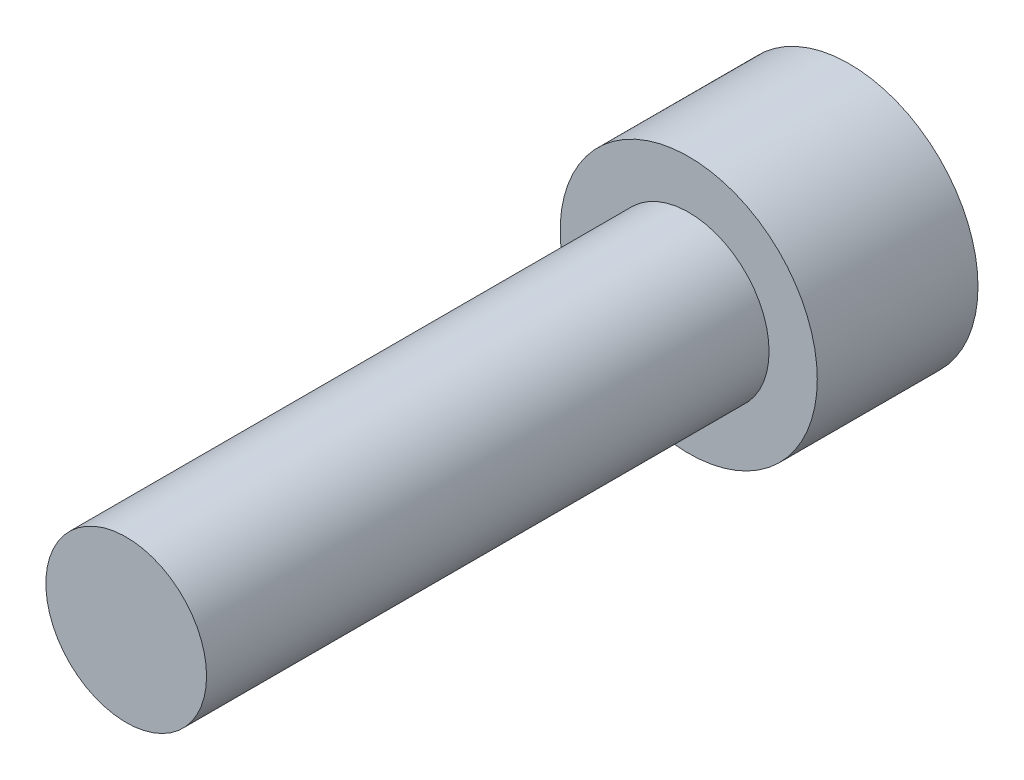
from build123d import *

# Parameters (mm, degrees)
HEX_2_DEPTH = 8


with BuildPart() as part:
    # Sketch6 → Revolve1 (revolve)
    with BuildSketch(Plane(origin=(0, 0, 0), x_dir=(0, 0, -1), z_dir=(1, 0, 0)), mode=Mode.PRIVATE) as revolve1_sk:
        Polygon((-35, 0), (-35, -5), (0, -5), (0, -8), (10, -8), (10, 0), align=None)
    revolve(revolve1_sk.sketch.rotate(Axis((0, 0, 35), (0, 0, -1)), 270), axis=Axis((0, 0, 35), (0, 0, -1)))

    # Sketch7 → HEX 2 (cut)
    with BuildSketch(Plane(origin=(0, 0, -10), x_dir=(-1, 0, 0), z_dir=(0, 0, -1))):
        Polygon((-4, 2.309401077), (-4, -2.309401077), (0, -4.618802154), (4, -2.309401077), (4, 2.309401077), (0, 4.618802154), align=None)
    extrude(amount=-HEX_2_DEPTH, mode=Mode.SUBTRACT)


solid = part.part
